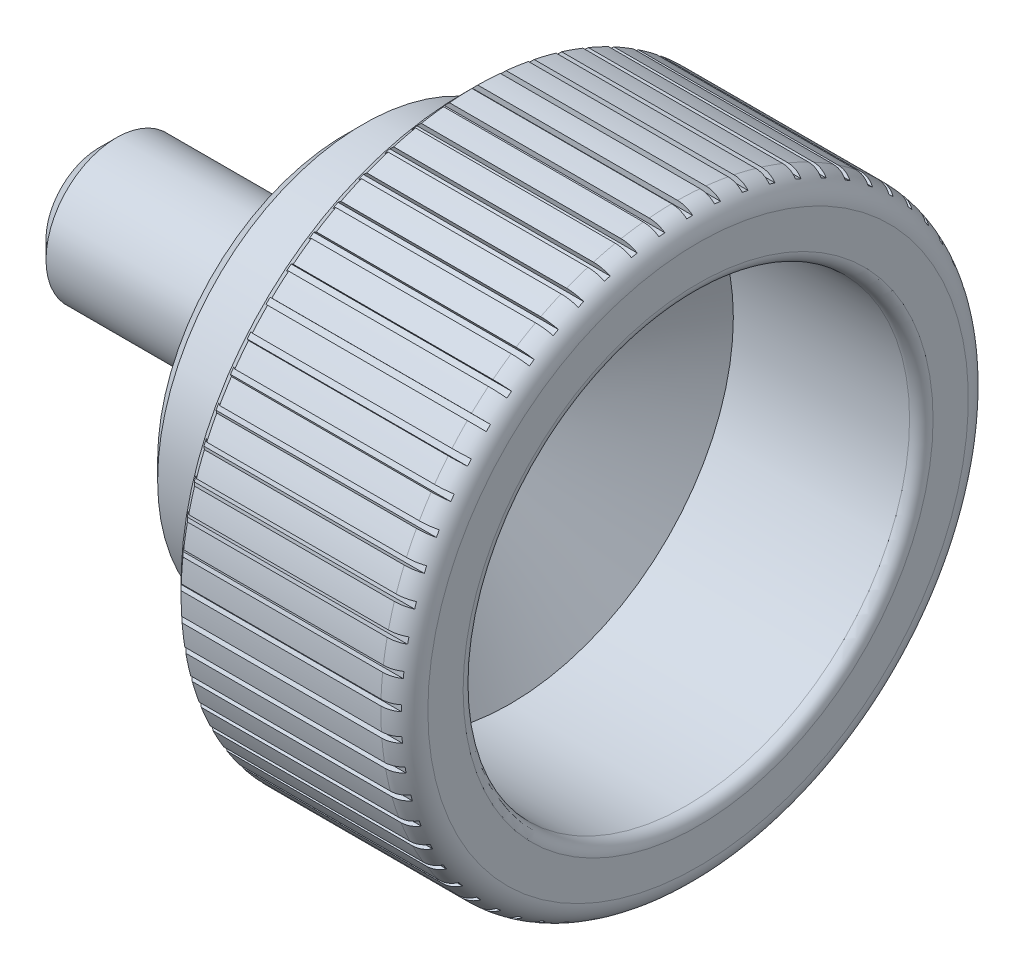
from build123d import *

# Parameters (mm, degrees)
CHANFREIN1_SIZE              = 1
CHANFREIN2_SIZE              = 1.5
ENL_V_MAT_EXTRU_1_REACH      = 64.056
ESQUISSE2_W                  = 0.5
ESQUISSE2_H                  = 0.85183459
R_P_TITION_CIRCULAIRE1_COUNT = 65


with BuildPart() as part:
    # Esquisse1 → Base-R_volution (revolve)
    with BuildSketch(Plane.XY, mode=Mode.PRIVATE) as base_r_volution_sk:
        with BuildLine():
            Line((0, 0), (0, 6))
            Line((0, 6), (21, 6))
            Line((21, 6), (21, 17.5))
            Line((21, 17.5), (31, 17.5))
            Line((31, 17.5), (31, 25))
            Line((31, 25), (49, 25))
            ThreePointArc((49, 25), (50.414213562, 24.414213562), (51, 23))
            Line((51, 23), (51, 20))
            ThreePointArc((51, 20), (50.707106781, 19.292893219), (50, 19))
            Line((50, 19), (35, 19))
            Line((35, 19), (23.583648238, 0))
            Line((23.583648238, 0), (0, 0))
        make_face()
    revolve(base_r_volution_sk.sketch.rotate(Axis((0, 0, 0), (1, 0, 0)), 90), axis=Axis((0, 0, 0), (1, 0, 0)))

    # Chanfrein1
    chanfrein1_edges = [part.edges().sort_by_distance(p)[0] for p in [
        (31, 0, -25),
    ]]
    chamfer(chanfrein1_edges, length=CHANFREIN1_SIZE)

    # Chanfrein2
    chanfrein2_edges = [part.edges().sort_by_distance(p)[0] for p in [
        (21, 0, -17.5),
        (0, 0, -6),
    ]]
    chamfer(chanfrein2_edges, length=CHANFREIN2_SIZE)

    # Enl_v. mat.-Extru.1: up to this cone (the profile starts inside it)
    enl_v_mat_extru_1_end = Plane(origin=(51, 0, 0), z_dir=(1, 0, 0)).offset(-43.999999) * Cone(1e-06, 152.556, 152.555999, align=(Align.CENTER, Align.CENTER, Align.MIN), mode=Mode.PRIVATE)
    # Esquisse2 → Enl_v. mat.-Extru.1 (cut, up to the surface)
    with BuildSketch(Plane(origin=(51, 0, 0), x_dir=(0, 0, -1), z_dir=(1, 0, 0)), mode=Mode.PRIVATE) as enl_v_mat_extru_1_sk1:
        with Locations((0, 24.956858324)):
            Rectangle(ESQUISSE2_W, ESQUISSE2_H)
    enl_v_mat_extru_1_tool1 = extrude(enl_v_mat_extru_1_sk1.sketch, amount=-ENL_V_MAT_EXTRU_1_REACH, mode=Mode.PRIVATE) & enl_v_mat_extru_1_end
    enl_v_mat_extru_1 = enl_v_mat_extru_1_tool1.solids().sort_by_distance((51, 24.956858, 0))[0]
    add(enl_v_mat_extru_1, mode=Mode.SUBTRACT)

    # R_p_tition circulaire1: Enl_v. mat.-Extru.1 ×65 about axis
    r_p_tition_circulaire1_axis = Axis((0, 0, 0), (1, 0, 0))
    for i in range(1, R_P_TITION_CIRCULAIRE1_COUNT):
        add(enl_v_mat_extru_1.rotate(r_p_tition_circulaire1_axis, i * 360 / R_P_TITION_CIRCULAIRE1_COUNT), mode=Mode.SUBTRACT)


solid = part.part
